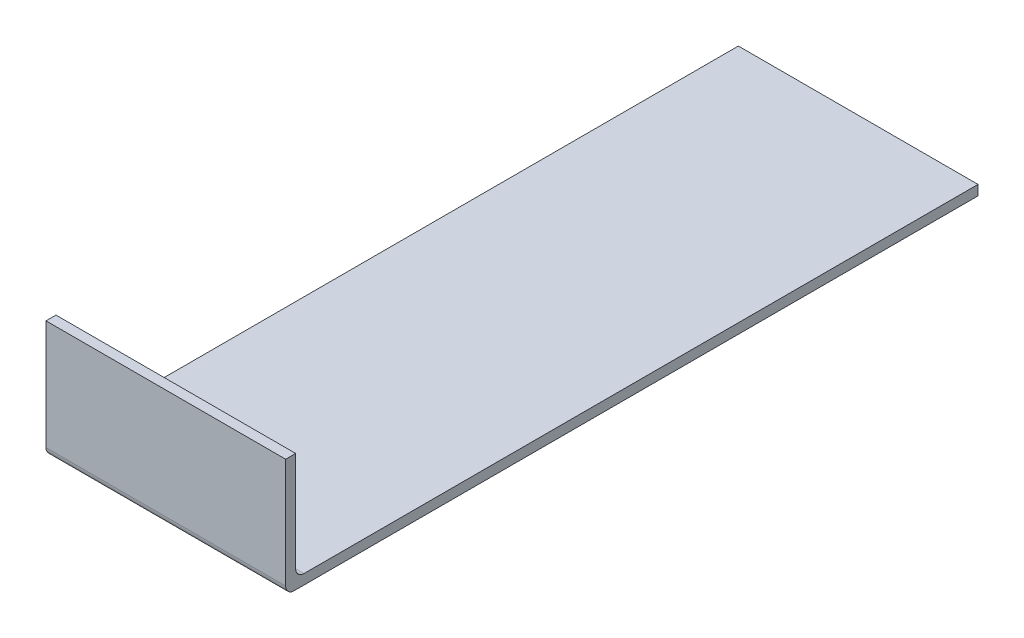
from build123d import *

# Parameters (mm, degrees)
SKETCH_1_W      = 144
SKETCH_1_H      = 6
EXTRUDE_1_DEPTH = 416
SKETCH_2_W      = 144
SKETCH_2_H      = 6
EXTRUDE_2_DEPTH = 65
FILLET_1_R      = 5


with BuildPart() as part:
    # Sketch 1 → Extrude 1 (new body)
    with BuildSketch(Plane.XY):
        with Locations((72, 3)):
            Rectangle(SKETCH_1_W, SKETCH_1_H)
    extrude(amount=EXTRUDE_1_DEPTH)

    # Sketch 2 → Extrude 2 (add)
    with BuildSketch(Plane(origin=(0, 6, 0), x_dir=(1, 0, 0), z_dir=(0, 1, 0))):
        with Locations((72, -413)):
            Rectangle(SKETCH_2_W, SKETCH_2_H)
    extrude(amount=EXTRUDE_2_DEPTH)

    # Fillet 1
    fillet_1_edges = [part.edges().sort_by_distance(p)[0] for p in [
        (72, 0, 416),
        (72, 6, 410),
    ]]
    fillet(fillet_1_edges, radius=FILLET_1_R)


solid = part.part
